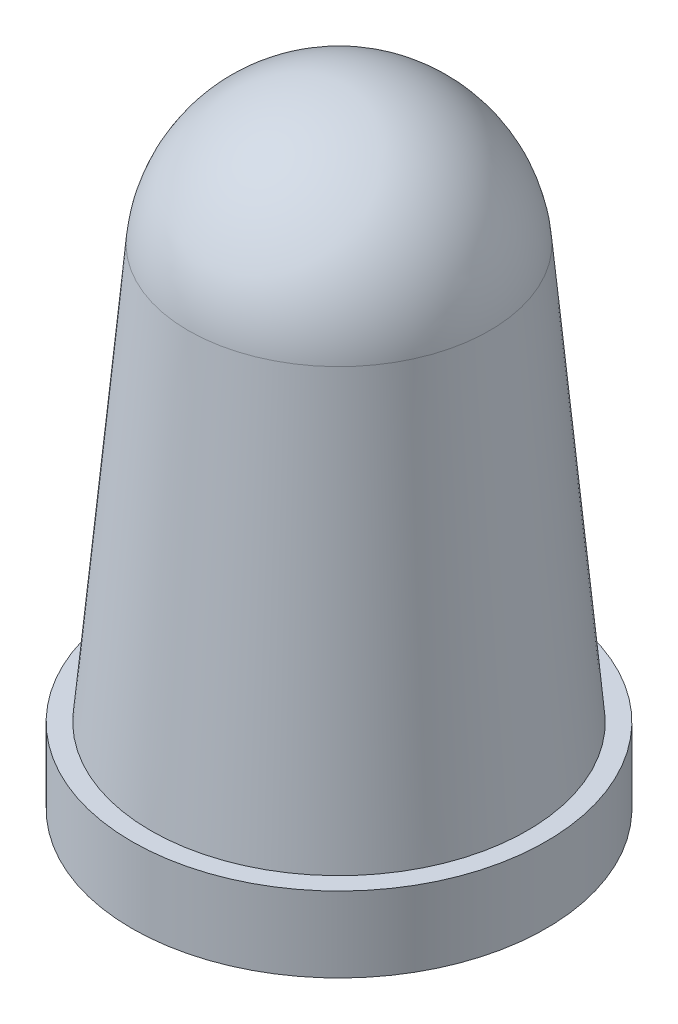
from build123d import *


with BuildPart() as part:
    # Esquisse1 → R_volution1 (revolve)
    with BuildSketch(Plane.XY, mode=Mode.PRIVATE) as r_volution1_sk:
        with BuildLine():
            Line((0, 0), (2.75, 0))
            Line((2.75, 0), (2.75, 1))
            Line((2.75, 1), (2.5, 1))
            Line((2.5, 1), (2, 6.5))
            ThreePointArc((2, 6.5), (1.353854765, 7.798539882), (0, 8.31891164))
            Line((0, 8.31891164), (0, 0))
        make_face()
    revolve(r_volution1_sk.sketch.rotate(Axis((0, 0, 0), (0, 1, 0)), 90), axis=Axis((0, 0, 0), (0, 1, 0)))


solid = part.part
